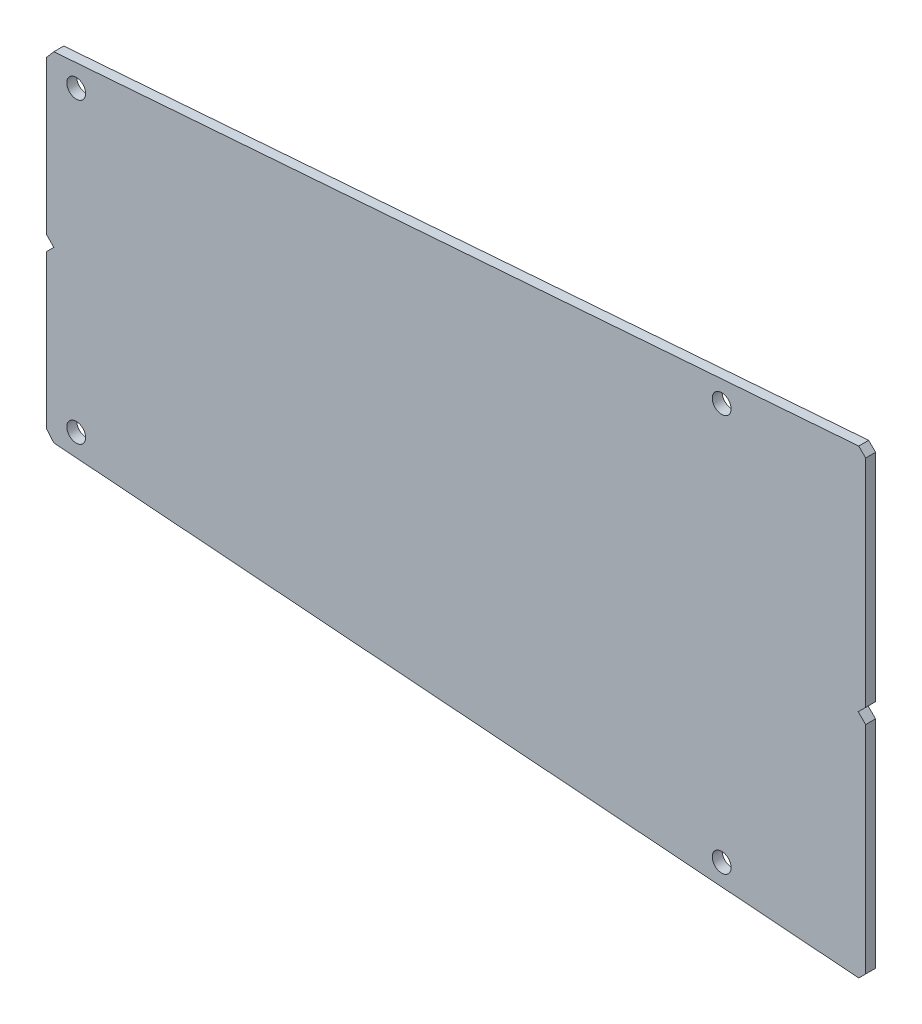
from build123d import *

# Parameters (mm, degrees)
ESQUISSE1_R      = 1.9
EXTRUSION1_DEPTH = 2
CHANFREIN1_SIZE  = 1.5
CHANFREIN1_SIZE2 = 1.398361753
CHANFREIN2_SIZE  = 1.5
CHANFREIN3_SIZE  = 1.5
CHANFREIN4_SIZE  = 1.5
CHANFREIN4_SIZE2 = 1.627601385


with BuildPart() as part:
    # Esquisse1 → Extrusion1 (new body)
    with BuildSketch(Plane.XY):
        Polygon((-49.438888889, 0), (115.561111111, 0), (115.561111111, 46.5), (-49.438888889, 34), align=None)
        with Locations((86.561111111, 40)):
            Circle(ESQUISSE1_R, mode=Mode.SUBTRACT)
        with Locations((-43.438888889, 30)):
            Circle(ESQUISSE1_R, mode=Mode.SUBTRACT)
    extrude(amount=EXTRUSION1_DEPTH)

    # Chanfrein1
    chanfrein1_edges = [part.edges().sort_by_distance(p)[0] for p in [
        (115.561111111, 46.5, 1),
    ]]
    chanfrein1_side = [part.faces().sort_by_distance(p)[0] for p in [
        (115.561111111, 23.25, 1),
    ]]
    chamfer(chanfrein1_edges, length=CHANFREIN1_SIZE, length2=CHANFREIN1_SIZE2, reference=chanfrein1_side[0])

    # Chanfrein2
    chanfrein2_edges = [part.edges().sort_by_distance(p)[0] for p in [
        (115.561111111, 0, 1),
    ]]
    chamfer(chanfrein2_edges, length=CHANFREIN2_SIZE)

    # Chanfrein3
    chanfrein3_edges = [part.edges().sort_by_distance(p)[0] for p in [
        (-49.438888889, 0, 1),
    ]]
    chamfer(chanfrein3_edges, length=CHANFREIN3_SIZE)

    # Chanfrein4
    chanfrein4_edges = [part.edges().sort_by_distance(p)[0] for p in [
        (-49.438888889, 34, 1),
    ]]
    chanfrein4_side = [part.faces().sort_by_distance(p)[0] for p in [
        (32.363928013, 40.197183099, 1),
    ]]
    chamfer(chanfrein4_edges, length=CHANFREIN4_SIZE, length2=CHANFREIN4_SIZE2, reference=chanfrein4_side[0])

    # Sym_trie1: part across plane


with BuildPart() as part_1:
    add(part.part)
    add(part.part.mirror(Plane(origin=(-49.438888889, 0, 2), x_dir=(0, 0, 1), z_dir=(0, 1, 0))))


solid = part_1.part
